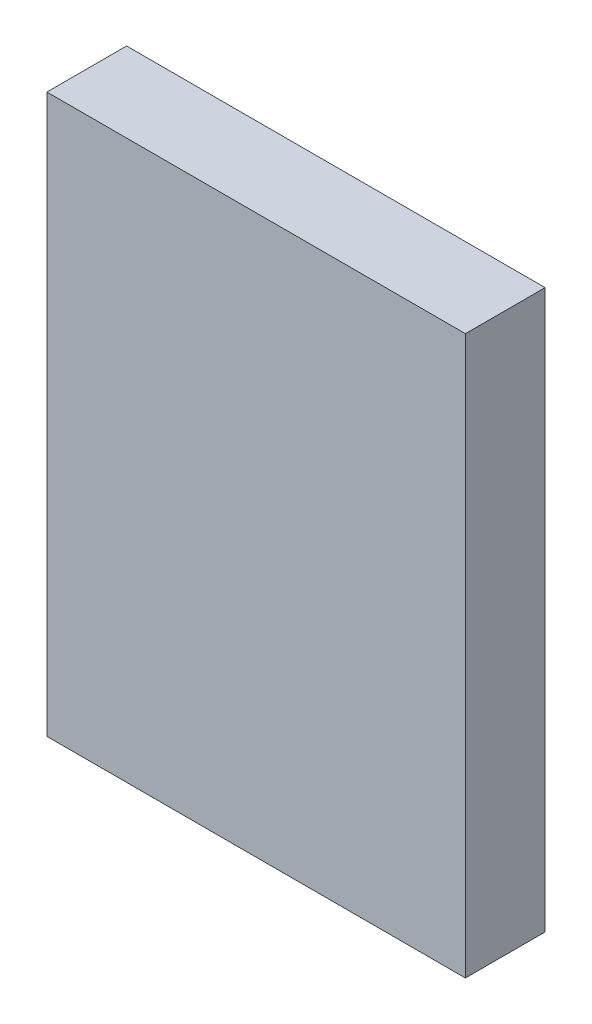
from build123d import *

# Parameters (mm, degrees)
ESQUISSE1_W        = 210
ESQUISSE1_H        = 280
BOSS_EXTRU_1_DEPTH = 40


with BuildPart() as part:
    # Esquisse1 → Boss.-Extru.1 (new body)
    with BuildSketch(Plane.XY):
        with Locations((105, 140)):
            Rectangle(ESQUISSE1_W, ESQUISSE1_H)
    extrude(amount=BOSS_EXTRU_1_DEPTH)


solid = part.part
